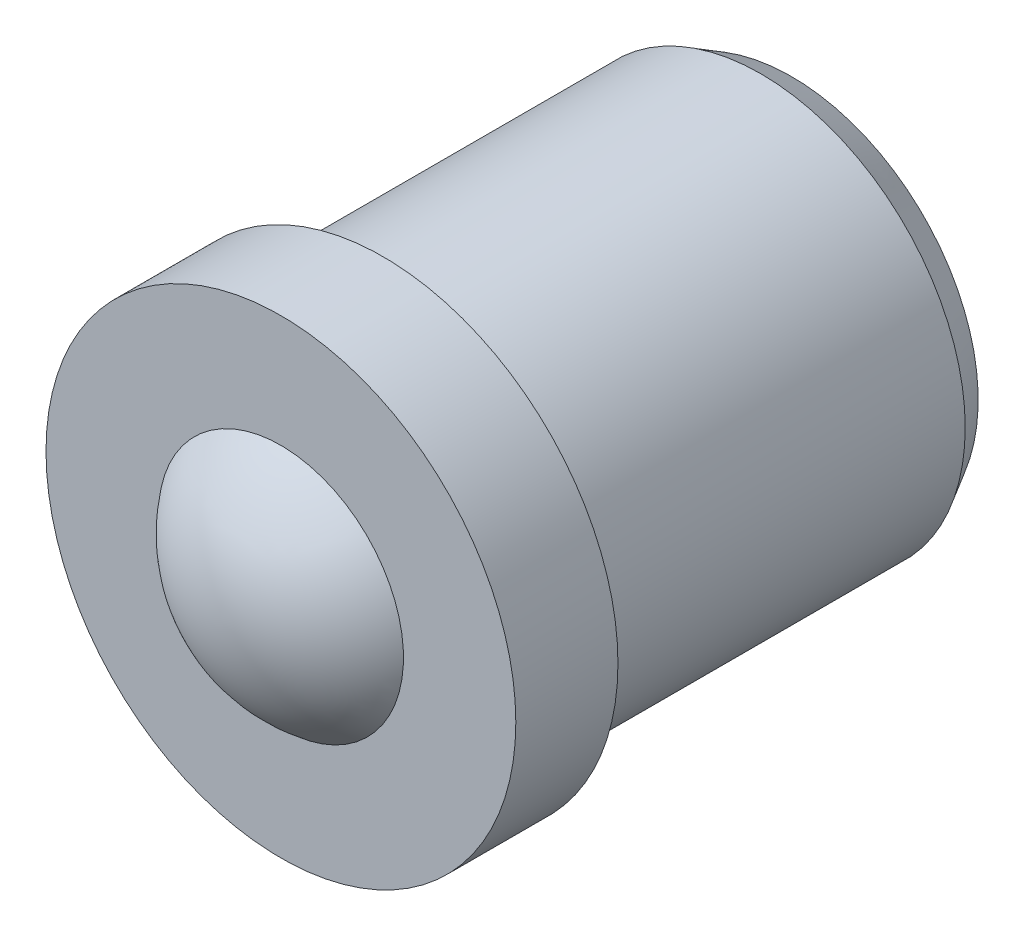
ISO-10303-21;
HEADER;
FILE_DESCRIPTION(('STEP AP214'),'2;1');
FILE_NAME('part.step','',(''),(''),'','','');
FILE_SCHEMA(('AUTOMOTIVE_DESIGN { 1 0 10303 214 1 1 1 1 }'));
ENDSEC;
DATA;
#1=APPLICATION_CONTEXT('core data for automotive mechanical design processes');
#2=APPLICATION_PROTOCOL_DEFINITION('international standard','automotive_design',2000,#1);
#3=PRODUCT_CONTEXT('',#1,'mechanical');
#4=PRODUCT('Part','Part','',(#3));
#5=PRODUCT_RELATED_PRODUCT_CATEGORY('part','',(#4));
#6=PRODUCT_DEFINITION_FORMATION('','',#4);
#7=PRODUCT_DEFINITION_CONTEXT('part definition',#1,'design');
#8=PRODUCT_DEFINITION('design','',#6,#7);
#9=PRODUCT_DEFINITION_SHAPE('','',#8);
#10=(LENGTH_UNIT() NAMED_UNIT(*) SI_UNIT(.MILLI.,.METRE.));
#11=(NAMED_UNIT(*) PLANE_ANGLE_UNIT() SI_UNIT($,.RADIAN.));
#12=(NAMED_UNIT(*) SI_UNIT($,.STERADIAN.) SOLID_ANGLE_UNIT());
#13=UNCERTAINTY_MEASURE_WITH_UNIT(LENGTH_MEASURE(1.E-05),#10,'distance_accuracy_value','');
#14=(GEOMETRIC_REPRESENTATION_CONTEXT(3) GLOBAL_UNCERTAINTY_ASSIGNED_CONTEXT((#13)) GLOBAL_UNIT_ASSIGNED_CONTEXT((#10,
#11,#12)) REPRESENTATION_CONTEXT('',''));
#15=CARTESIAN_POINT('',(0.,0.,0.));
#16=DIRECTION('',(0.,0.,1.));
#17=DIRECTION('',(1.,0.,0.));
#18=AXIS2_PLACEMENT_3D('',#15,#16,#17);
#19=CARTESIAN_POINT('',(0.,0.,-4.));
#20=DIRECTION('',(0.,0.,1.));
#21=DIRECTION('',(-1.,0.,0.));
#22=AXIS2_PLACEMENT_3D('',#19,#20,#21);
#23=PLANE('',#22);
#24=CARTESIAN_POINT('',(0.,0.,-4.));
#25=DIRECTION('',(0.,0.,1.));
#26=DIRECTION('',(-1.,0.,0.));
#27=AXIS2_PLACEMENT_3D('',#24,#25,#26);
#28=CIRCLE('',#27,1.82679491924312);
#29=CARTESIAN_POINT('',(-1.82679491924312,0.,-4.));
#30=VERTEX_POINT('',#29);
#31=EDGE_CURVE('E18',#30,#30,#28,.T.);
#32=ORIENTED_EDGE('',*,*,#31,.F.);
#33=EDGE_LOOP('',(#32));
#34=FACE_BOUND('',#33,.T.);
#35=ADVANCED_FACE('F12',(#34),#23,.F.);
#36=CARTESIAN_POINT('',(0.,0.,-4.));
#37=DIRECTION('',(0.,0.,1.));
#38=DIRECTION('',(-1.,0.,0.));
#39=AXIS2_PLACEMENT_3D('',#36,#37,#38);
#40=CONICAL_SURFACE('',#39,1.82679491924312,0.523598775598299);
#41=CARTESIAN_POINT('',(0.,0.,-3.7));
#42=DIRECTION('',(0.,0.,1.));
#43=DIRECTION('',(-1.,0.,0.));
#44=AXIS2_PLACEMENT_3D('',#41,#42,#43);
#45=CIRCLE('',#44,2.);
#46=CARTESIAN_POINT('',(-2.,0.,-3.7));
#47=VERTEX_POINT('',#46);
#48=EDGE_CURVE('E22',#47,#47,#45,.T.);
#49=ORIENTED_EDGE('',*,*,#48,.F.);
#50=EDGE_LOOP('',(#49));
#51=FACE_BOUND('',#50,.T.);
#52=ORIENTED_EDGE('',*,*,#31,.T.);
#53=EDGE_LOOP('',(#52));
#54=FACE_BOUND('',#53,.T.);
#55=ADVANCED_FACE('F55',(#51,#54),#40,.T.);
#56=CARTESIAN_POINT('',(0.,0.,1.));
#57=DIRECTION('',(0.,0.,1.));
#58=DIRECTION('',(-1.,0.,0.));
#59=AXIS2_PLACEMENT_3D('',#56,#57,#58);
#60=CYLINDRICAL_SURFACE('',#59,2.);
#61=CARTESIAN_POINT('',(0.,0.,0.));
#62=DIRECTION('',(0.,0.,1.));
#63=DIRECTION('',(-1.,0.,0.));
#64=AXIS2_PLACEMENT_3D('',#61,#62,#63);
#65=CIRCLE('',#64,2.);
#66=CARTESIAN_POINT('',(-2.,0.,0.));
#67=VERTEX_POINT('',#66);
#68=EDGE_CURVE('E26',#67,#67,#65,.T.);
#69=ORIENTED_EDGE('',*,*,#68,.F.);
#70=EDGE_LOOP('',(#69));
#71=FACE_BOUND('',#70,.T.);
#72=ORIENTED_EDGE('',*,*,#48,.T.);
#73=EDGE_LOOP('',(#72));
#74=FACE_BOUND('',#73,.T.);
#75=ADVANCED_FACE('F49',(#71,#74),#60,.T.);
#76=CARTESIAN_POINT('',(-2.,0.,0.));
#77=DIRECTION('',(0.,0.,1.));
#78=DIRECTION('',(-1.,0.,0.));
#79=AXIS2_PLACEMENT_3D('',#76,#77,#78);
#80=PLANE('',#79);
#81=CARTESIAN_POINT('',(0.,0.,0.));
#82=DIRECTION('',(0.,0.,1.));
#83=DIRECTION('',(-1.,0.,0.));
#84=AXIS2_PLACEMENT_3D('',#81,#82,#83);
#85=CIRCLE('',#84,2.3);
#86=CARTESIAN_POINT('',(-2.3,0.,0.));
#87=VERTEX_POINT('',#86);
#88=EDGE_CURVE('E31',#87,#87,#85,.T.);
#89=ORIENTED_EDGE('',*,*,#88,.F.);
#90=EDGE_LOOP('',(#89));
#91=FACE_BOUND('',#90,.T.);
#92=ORIENTED_EDGE('',*,*,#68,.T.);
#93=EDGE_LOOP('',(#92));
#94=FACE_BOUND('',#93,.T.);
#95=ADVANCED_FACE('F43',(#91,#94),#80,.F.);
#96=CARTESIAN_POINT('',(0.,0.,1.));
#97=DIRECTION('',(0.,0.,1.));
#98=DIRECTION('',(-1.,0.,0.));
#99=AXIS2_PLACEMENT_3D('',#96,#97,#98);
#100=CYLINDRICAL_SURFACE('',#99,2.3);
#101=CARTESIAN_POINT('',(0.,0.,1.));
#102=DIRECTION('',(0.,0.,1.));
#103=DIRECTION('',(-1.,0.,0.));
#104=AXIS2_PLACEMENT_3D('',#101,#102,#103);
#105=CIRCLE('',#104,2.3);
#106=CARTESIAN_POINT('',(-2.3,0.,1.));
#107=VERTEX_POINT('',#106);
#108=EDGE_CURVE('E34',#107,#107,#105,.T.);
#109=ORIENTED_EDGE('',*,*,#108,.F.);
#110=EDGE_LOOP('',(#109));
#111=FACE_BOUND('',#110,.T.);
#112=ORIENTED_EDGE('',*,*,#88,.T.);
#113=EDGE_LOOP('',(#112));
#114=FACE_BOUND('',#113,.T.);
#115=ADVANCED_FACE('F40',(#111,#114),#100,.T.);
#116=CARTESIAN_POINT('',(-2.3,0.,1.));
#117=DIRECTION('',(0.,0.,-1.));
#118=DIRECTION('',(1.,0.,0.));
#119=AXIS2_PLACEMENT_3D('',#116,#117,#118);
#120=PLANE('',#119);
#121=ORIENTED_EDGE('',*,*,#108,.T.);
#122=EDGE_LOOP('',(#121));
#123=FACE_BOUND('',#122,.T.);
#124=CARTESIAN_POINT('',(0.,0.,1.));
#125=DIRECTION('',(0.,0.,1.));
#126=DIRECTION('',(-1.,0.,0.));
#127=AXIS2_PLACEMENT_3D('',#124,#125,#126);
#128=CIRCLE('',#127,1.2);
#129=CARTESIAN_POINT('',(-1.2,0.,1.));
#130=VERTEX_POINT('',#129);
#131=EDGE_CURVE('E8',#130,#130,#128,.F.);
#132=ORIENTED_EDGE('',*,*,#131,.T.);
#133=EDGE_LOOP('',(#132));
#134=FACE_BOUND('',#133,.T.);
#135=ADVANCED_FACE('F38',(#123,#134),#120,.F.);
#136=CARTESIAN_POINT('',(0.,0.,0.1));
#137=DIRECTION('',(0.,0.,-1.));
#138=DIRECTION('',(-1.,0.,0.));
#139=AXIS2_PLACEMENT_3D('',#136,#137,#138);
#140=SPHERICAL_SURFACE('',#139,1.5);
#141=ORIENTED_EDGE('',*,*,#131,.F.);
#142=EDGE_LOOP('',(#141));
#143=FACE_BOUND('',#142,.T.);
#144=ADVANCED_FACE('F68',(#143),#140,.T.);
#145=CLOSED_SHELL('',(#35,#55,#75,#95,#115,#135,#144));
#146=MANIFOLD_SOLID_BREP('B1',#145);
#147=ADVANCED_BREP_SHAPE_REPRESENTATION('',(#18,#146),#14);
#148=SHAPE_DEFINITION_REPRESENTATION(#9,#147);
ENDSEC;
END-ISO-10303-21;
